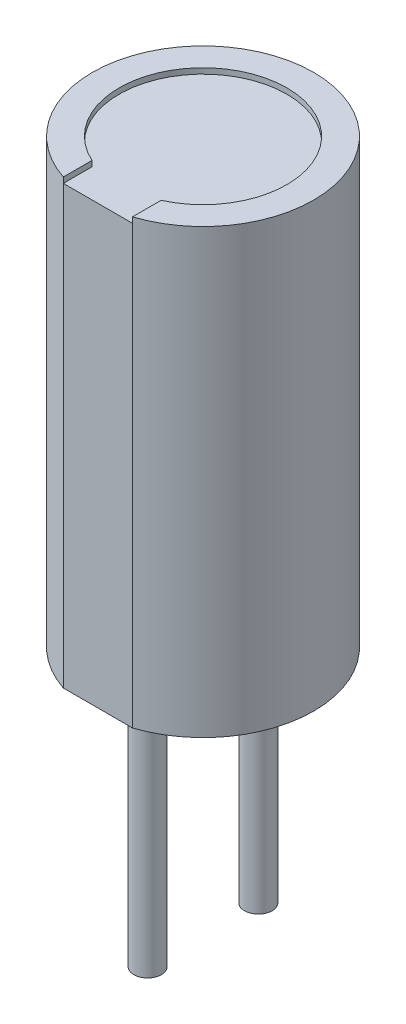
ISO-10303-21;
HEADER;
FILE_DESCRIPTION(('STEP AP214'),'2;1');
FILE_NAME('part.step','',(''),(''),'','','');
FILE_SCHEMA(('AUTOMOTIVE_DESIGN { 1 0 10303 214 1 1 1 1 }'));
ENDSEC;
DATA;
#1=APPLICATION_CONTEXT('core data for automotive mechanical design processes');
#2=APPLICATION_PROTOCOL_DEFINITION('international standard','automotive_design',2000,#1);
#3=PRODUCT_CONTEXT('',#1,'mechanical');
#4=PRODUCT('Part','Part','',(#3));
#5=PRODUCT_RELATED_PRODUCT_CATEGORY('part','',(#4));
#6=PRODUCT_DEFINITION_FORMATION('','',#4);
#7=PRODUCT_DEFINITION_CONTEXT('part definition',#1,'design');
#8=PRODUCT_DEFINITION('design','',#6,#7);
#9=PRODUCT_DEFINITION_SHAPE('','',#8);
#10=(LENGTH_UNIT() NAMED_UNIT(*) SI_UNIT(.MILLI.,.METRE.));
#11=(NAMED_UNIT(*) PLANE_ANGLE_UNIT() SI_UNIT($,.RADIAN.));
#12=(NAMED_UNIT(*) SI_UNIT($,.STERADIAN.) SOLID_ANGLE_UNIT());
#13=UNCERTAINTY_MEASURE_WITH_UNIT(LENGTH_MEASURE(1.E-05),#10,'distance_accuracy_value','');
#14=(GEOMETRIC_REPRESENTATION_CONTEXT(3) GLOBAL_UNCERTAINTY_ASSIGNED_CONTEXT((#13)) GLOBAL_UNIT_ASSIGNED_CONTEXT((#10,
#11,#12)) REPRESENTATION_CONTEXT('',''));
#15=CARTESIAN_POINT('',(0.,0.,0.));
#16=DIRECTION('',(0.,0.,1.));
#17=DIRECTION('',(1.,0.,0.));
#18=AXIS2_PLACEMENT_3D('',#15,#16,#17);
#19=CARTESIAN_POINT('',(-1.,8.,1.9));
#20=DIRECTION('',(0.,0.,-1.));
#21=DIRECTION('',(-1.,0.,0.));
#22=AXIS2_PLACEMENT_3D('',#19,#20,#21);
#23=PLANE('',#22);
#24=DIRECTION('',(1.,0.,0.));
#25=VECTOR('',#24,1.);
#26=CARTESIAN_POINT('',(-0.62449979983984,7.9,1.9));
#27=LINE('',#26,#25);
#28=CARTESIAN_POINT('',(-0.62449979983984,7.9,1.9));
#29=VERTEX_POINT('',#28);
#30=CARTESIAN_POINT('',(0.624499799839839,7.9,1.9));
#31=VERTEX_POINT('',#30);
#32=EDGE_CURVE('E105',#29,#31,#27,.T.);
#33=ORIENTED_EDGE('',*,*,#32,.F.);
#34=DIRECTION('',(0.,-1.,0.));
#35=VECTOR('',#34,1.);
#36=CARTESIAN_POINT('',(-0.62449979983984,8.,1.9));
#37=LINE('',#36,#35);
#38=CARTESIAN_POINT('',(-0.62449979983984,0.,1.9));
#39=VERTEX_POINT('',#38);
#40=EDGE_CURVE('E50',#39,#29,#37,.F.);
#41=ORIENTED_EDGE('',*,*,#40,.F.);
#42=DIRECTION('',(-1.,0.,0.));
#43=VECTOR('',#42,1.);
#44=CARTESIAN_POINT('',(0.,0.,1.9));
#45=LINE('',#44,#43);
#46=CARTESIAN_POINT('',(0.624499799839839,0.,1.9));
#47=VERTEX_POINT('',#46);
#48=EDGE_CURVE('E126',#47,#39,#45,.T.);
#49=ORIENTED_EDGE('',*,*,#48,.F.);
#50=DIRECTION('',(0.,-1.,0.));
#51=VECTOR('',#50,1.);
#52=CARTESIAN_POINT('',(0.62449979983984,8.,1.9));
#53=LINE('',#52,#51);
#54=EDGE_CURVE('E118',#31,#47,#53,.T.);
#55=ORIENTED_EDGE('',*,*,#54,.F.);
#56=EDGE_LOOP('',(#33,#41,#49,#55));
#57=FACE_BOUND('',#56,.T.);
#58=ADVANCED_FACE('F27',(#57),#23,.F.);
#59=CARTESIAN_POINT('',(0.,0.,0.));
#60=DIRECTION('',(0.,1.,0.));
#61=DIRECTION('',(0.,0.,1.));
#62=AXIS2_PLACEMENT_3D('',#59,#60,#61);
#63=PLANE('',#62);
#64=CARTESIAN_POINT('',(0.,0.,1.));
#65=DIRECTION('',(0.,1.,0.));
#66=DIRECTION('',(0.,0.,1.));
#67=AXIS2_PLACEMENT_3D('',#64,#65,#66);
#68=CIRCLE('',#67,0.25);
#69=CARTESIAN_POINT('',(0.,0.,1.25));
#70=VERTEX_POINT('',#69);
#71=EDGE_CURVE('E35',#70,#70,#68,.F.);
#72=ORIENTED_EDGE('',*,*,#71,.F.);
#73=EDGE_LOOP('',(#72));
#74=FACE_BOUND('',#73,.T.);
#75=CARTESIAN_POINT('',(0.,0.,0.));
#76=DIRECTION('',(0.,1.,0.));
#77=DIRECTION('',(0.,0.,1.));
#78=AXIS2_PLACEMENT_3D('',#75,#76,#77);
#79=CIRCLE('',#78,2.);
#80=EDGE_CURVE('E122',#47,#39,#79,.T.);
#81=ORIENTED_EDGE('',*,*,#80,.F.);
#82=ORIENTED_EDGE('',*,*,#48,.T.);
#83=EDGE_LOOP('',(#81,#82));
#84=FACE_BOUND('',#83,.T.);
#85=CARTESIAN_POINT('',(0.,0.,-1.));
#86=DIRECTION('',(0.,1.,0.));
#87=DIRECTION('',(0.,0.,1.));
#88=AXIS2_PLACEMENT_3D('',#85,#86,#87);
#89=CIRCLE('',#88,0.25);
#90=CARTESIAN_POINT('',(0.,0.,-0.75));
#91=VERTEX_POINT('',#90);
#92=EDGE_CURVE('E11',#91,#91,#89,.F.);
#93=ORIENTED_EDGE('',*,*,#92,.F.);
#94=EDGE_LOOP('',(#93));
#95=FACE_BOUND('',#94,.T.);
#96=ADVANCED_FACE('F132',(#74,#84,#95),#63,.F.);
#97=CARTESIAN_POINT('',(0.,8.,0.));
#98=DIRECTION('',(0.,-1.,0.));
#99=DIRECTION('',(0.,0.,-1.));
#100=AXIS2_PLACEMENT_3D('',#97,#98,#99);
#101=CYLINDRICAL_SURFACE('',#100,2.);
#102=CARTESIAN_POINT('',(0.,8.,0.));
#103=DIRECTION('',(0.,1.,0.));
#104=DIRECTION('',(0.,0.,1.));
#105=AXIS2_PLACEMENT_3D('',#102,#103,#104);
#106=CIRCLE('',#105,2.);
#107=CARTESIAN_POINT('',(0.624499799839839,8.,1.9));
#108=VERTEX_POINT('',#107);
#109=CARTESIAN_POINT('',(-0.62449979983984,8.,1.9));
#110=VERTEX_POINT('',#109);
#111=EDGE_CURVE('E97',#108,#110,#106,.T.);
#112=ORIENTED_EDGE('',*,*,#111,.F.);
#113=EDGE_CURVE('E119',#108,#31,#53,.T.);
#114=ORIENTED_EDGE('',*,*,#113,.T.);
#115=ORIENTED_EDGE('',*,*,#54,.T.);
#116=ORIENTED_EDGE('',*,*,#80,.T.);
#117=ORIENTED_EDGE('',*,*,#40,.T.);
#118=DIRECTION('',(0.,1.,0.));
#119=VECTOR('',#118,1.);
#120=CARTESIAN_POINT('',(-0.62449979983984,7.9,1.9));
#121=LINE('',#120,#119);
#122=EDGE_CURVE('E83',#29,#110,#121,.T.);
#123=ORIENTED_EDGE('',*,*,#122,.T.);
#124=EDGE_LOOP('',(#112,#114,#115,#116,#117,#123));
#125=FACE_BOUND('',#124,.T.);
#126=ADVANCED_FACE('F29',(#125),#101,.T.);
#127=CARTESIAN_POINT('',(0.,8.,0.));
#128=DIRECTION('',(0.,1.,0.));
#129=DIRECTION('',(0.,0.,1.));
#130=AXIS2_PLACEMENT_3D('',#127,#128,#129);
#131=PLANE('',#130);
#132=DIRECTION('',(0.,0.,-1.));
#133=VECTOR('',#132,1.);
#134=CARTESIAN_POINT('',(0.624499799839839,8.,1.38143930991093));
#135=LINE('',#134,#133);
#136=CARTESIAN_POINT('',(0.624499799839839,8.,1.38143930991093));
#137=VERTEX_POINT('',#136);
#138=EDGE_CURVE('E98',#108,#137,#135,.T.);
#139=ORIENTED_EDGE('',*,*,#138,.F.);
#140=ORIENTED_EDGE('',*,*,#111,.T.);
#141=DIRECTION('',(0.,0.,1.));
#142=VECTOR('',#141,1.);
#143=CARTESIAN_POINT('',(-0.624499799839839,8.,1.38143930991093));
#144=LINE('',#143,#142);
#145=CARTESIAN_POINT('',(-0.624499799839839,8.,1.38143930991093));
#146=VERTEX_POINT('',#145);
#147=EDGE_CURVE('E79',#146,#110,#144,.T.);
#148=ORIENTED_EDGE('',*,*,#147,.F.);
#149=CARTESIAN_POINT('',(0.,8.,0.));
#150=DIRECTION('',(0.,1.,0.));
#151=DIRECTION('',(0.,0.,1.));
#152=AXIS2_PLACEMENT_3D('',#149,#150,#151);
#153=CIRCLE('',#152,1.51603910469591);
#154=EDGE_CURVE('E87',#137,#146,#153,.T.);
#155=ORIENTED_EDGE('',*,*,#154,.F.);
#156=EDGE_LOOP('',(#139,#140,#148,#155));
#157=FACE_BOUND('',#156,.T.);
#158=ADVANCED_FACE('F95',(#157),#131,.T.);
#159=CARTESIAN_POINT('',(0.,-4.5,1.));
#160=DIRECTION('',(0.,1.,0.));
#161=DIRECTION('',(0.,0.,1.));
#162=AXIS2_PLACEMENT_3D('',#159,#160,#161);
#163=CYLINDRICAL_SURFACE('',#162,0.25);
#164=CARTESIAN_POINT('',(0.,-4.5,1.));
#165=DIRECTION('',(0.,-1.,0.));
#166=DIRECTION('',(0.,0.,-1.));
#167=AXIS2_PLACEMENT_3D('',#164,#165,#166);
#168=CIRCLE('',#167,0.25);
#169=CARTESIAN_POINT('',(0.,-4.5,0.75));
#170=VERTEX_POINT('',#169);
#171=EDGE_CURVE('E114',#170,#170,#168,.T.);
#172=ORIENTED_EDGE('',*,*,#171,.F.);
#173=EDGE_LOOP('',(#172));
#174=FACE_BOUND('',#173,.T.);
#175=ORIENTED_EDGE('',*,*,#71,.T.);
#176=EDGE_LOOP('',(#175));
#177=FACE_BOUND('',#176,.T.);
#178=ADVANCED_FACE('F130',(#174,#177),#163,.T.);
#179=CARTESIAN_POINT('',(0.,-4.5,1.));
#180=DIRECTION('',(0.,-1.,0.));
#181=DIRECTION('',(0.,0.,-1.));
#182=AXIS2_PLACEMENT_3D('',#179,#180,#181);
#183=PLANE('',#182);
#184=ORIENTED_EDGE('',*,*,#171,.T.);
#185=EDGE_LOOP('',(#184));
#186=FACE_BOUND('',#185,.T.);
#187=ADVANCED_FACE('F143',(#186),#183,.T.);
#188=CARTESIAN_POINT('',(0.,-4.5,-1.));
#189=DIRECTION('',(0.,1.,0.));
#190=DIRECTION('',(0.,0.,1.));
#191=AXIS2_PLACEMENT_3D('',#188,#189,#190);
#192=CYLINDRICAL_SURFACE('',#191,0.25);
#193=CARTESIAN_POINT('',(0.,-4.5,-1.));
#194=DIRECTION('',(0.,-1.,0.));
#195=DIRECTION('',(0.,0.,-1.));
#196=AXIS2_PLACEMENT_3D('',#193,#194,#195);
#197=CIRCLE('',#196,0.25);
#198=CARTESIAN_POINT('',(0.,-4.5,-1.25));
#199=VERTEX_POINT('',#198);
#200=EDGE_CURVE('E110',#199,#199,#197,.T.);
#201=ORIENTED_EDGE('',*,*,#200,.F.);
#202=EDGE_LOOP('',(#201));
#203=FACE_BOUND('',#202,.T.);
#204=ORIENTED_EDGE('',*,*,#92,.T.);
#205=EDGE_LOOP('',(#204));
#206=FACE_BOUND('',#205,.T.);
#207=ADVANCED_FACE('F140',(#203,#206),#192,.T.);
#208=CARTESIAN_POINT('',(0.,-4.5,-1.));
#209=DIRECTION('',(0.,-1.,0.));
#210=DIRECTION('',(0.,0.,-1.));
#211=AXIS2_PLACEMENT_3D('',#208,#209,#210);
#212=PLANE('',#211);
#213=ORIENTED_EDGE('',*,*,#200,.T.);
#214=EDGE_LOOP('',(#213));
#215=FACE_BOUND('',#214,.T.);
#216=ADVANCED_FACE('F142',(#215),#212,.T.);
#217=CARTESIAN_POINT('',(0.,7.9,0.));
#218=DIRECTION('',(0.,1.,0.));
#219=DIRECTION('',(0.,0.,1.));
#220=AXIS2_PLACEMENT_3D('',#217,#218,#219);
#221=CYLINDRICAL_SURFACE('',#220,1.51603910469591);
#222=ORIENTED_EDGE('',*,*,#154,.T.);
#223=DIRECTION('',(0.,1.,0.));
#224=VECTOR('',#223,1.);
#225=CARTESIAN_POINT('',(-0.624499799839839,7.9,1.38143930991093));
#226=LINE('',#225,#224);
#227=CARTESIAN_POINT('',(-0.624499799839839,7.9,1.38143930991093));
#228=VERTEX_POINT('',#227);
#229=EDGE_CURVE('E75',#228,#146,#226,.T.);
#230=ORIENTED_EDGE('',*,*,#229,.F.);
#231=CARTESIAN_POINT('',(0.,7.9,0.));
#232=DIRECTION('',(0.,1.,0.));
#233=DIRECTION('',(0.,0.,1.));
#234=AXIS2_PLACEMENT_3D('',#231,#232,#233);
#235=CIRCLE('',#234,1.51603910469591);
#236=CARTESIAN_POINT('',(0.624499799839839,7.9,1.38143930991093));
#237=VERTEX_POINT('',#236);
#238=EDGE_CURVE('E100',#237,#228,#235,.T.);
#239=ORIENTED_EDGE('',*,*,#238,.F.);
#240=DIRECTION('',(0.,1.,0.));
#241=VECTOR('',#240,1.);
#242=CARTESIAN_POINT('',(0.624499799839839,7.9,1.38143930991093));
#243=LINE('',#242,#241);
#244=EDGE_CURVE('E89',#237,#137,#243,.T.);
#245=ORIENTED_EDGE('',*,*,#244,.T.);
#246=EDGE_LOOP('',(#222,#230,#239,#245));
#247=FACE_BOUND('',#246,.T.);
#248=ADVANCED_FACE('F88',(#247),#221,.F.);
#249=CARTESIAN_POINT('',(0.624499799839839,7.9,1.38143930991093));
#250=DIRECTION('',(1.,0.,0.));
#251=DIRECTION('',(0.,0.,-1.));
#252=AXIS2_PLACEMENT_3D('',#249,#250,#251);
#253=PLANE('',#252);
#254=ORIENTED_EDGE('',*,*,#138,.T.);
#255=ORIENTED_EDGE('',*,*,#244,.F.);
#256=DIRECTION('',(0.,0.,-1.));
#257=VECTOR('',#256,1.);
#258=CARTESIAN_POINT('',(0.624499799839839,7.9,1.38143930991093));
#259=LINE('',#258,#257);
#260=EDGE_CURVE('E84',#31,#237,#259,.T.);
#261=ORIENTED_EDGE('',*,*,#260,.F.);
#262=ORIENTED_EDGE('',*,*,#113,.F.);
#263=EDGE_LOOP('',(#254,#255,#261,#262));
#264=FACE_BOUND('',#263,.T.);
#265=ADVANCED_FACE('F174',(#264),#253,.F.);
#266=CARTESIAN_POINT('',(-0.624499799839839,7.9,1.38143930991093));
#267=DIRECTION('',(-1.,0.,0.));
#268=DIRECTION('',(0.,0.,1.));
#269=AXIS2_PLACEMENT_3D('',#266,#267,#268);
#270=PLANE('',#269);
#271=ORIENTED_EDGE('',*,*,#147,.T.);
#272=ORIENTED_EDGE('',*,*,#122,.F.);
#273=DIRECTION('',(0.,0.,1.));
#274=VECTOR('',#273,1.);
#275=CARTESIAN_POINT('',(-0.624499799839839,7.9,1.38143930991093));
#276=LINE('',#275,#274);
#277=EDGE_CURVE('E42',#228,#29,#276,.T.);
#278=ORIENTED_EDGE('',*,*,#277,.F.);
#279=ORIENTED_EDGE('',*,*,#229,.T.);
#280=EDGE_LOOP('',(#271,#272,#278,#279));
#281=FACE_BOUND('',#280,.T.);
#282=ADVANCED_FACE('F77',(#281),#270,.F.);
#283=CARTESIAN_POINT('',(0.,7.9,0.));
#284=DIRECTION('',(0.,1.,0.));
#285=DIRECTION('',(0.,0.,1.));
#286=AXIS2_PLACEMENT_3D('',#283,#284,#285);
#287=PLANE('',#286);
#288=ORIENTED_EDGE('',*,*,#238,.T.);
#289=ORIENTED_EDGE('',*,*,#277,.T.);
#290=ORIENTED_EDGE('',*,*,#32,.T.);
#291=ORIENTED_EDGE('',*,*,#260,.T.);
#292=EDGE_LOOP('',(#288,#289,#290,#291));
#293=FACE_BOUND('',#292,.T.);
#294=ADVANCED_FACE('F172',(#293),#287,.T.);
#295=CLOSED_SHELL('',(#58,#96,#126,#158,#178,#187,#207,#216,#248,#265,#282,#294));
#296=MANIFOLD_SOLID_BREP('B2',#295);
#297=ADVANCED_BREP_SHAPE_REPRESENTATION('',(#18,#296),#14);
#298=SHAPE_DEFINITION_REPRESENTATION(#9,#297);
ENDSEC;
END-ISO-10303-21;
